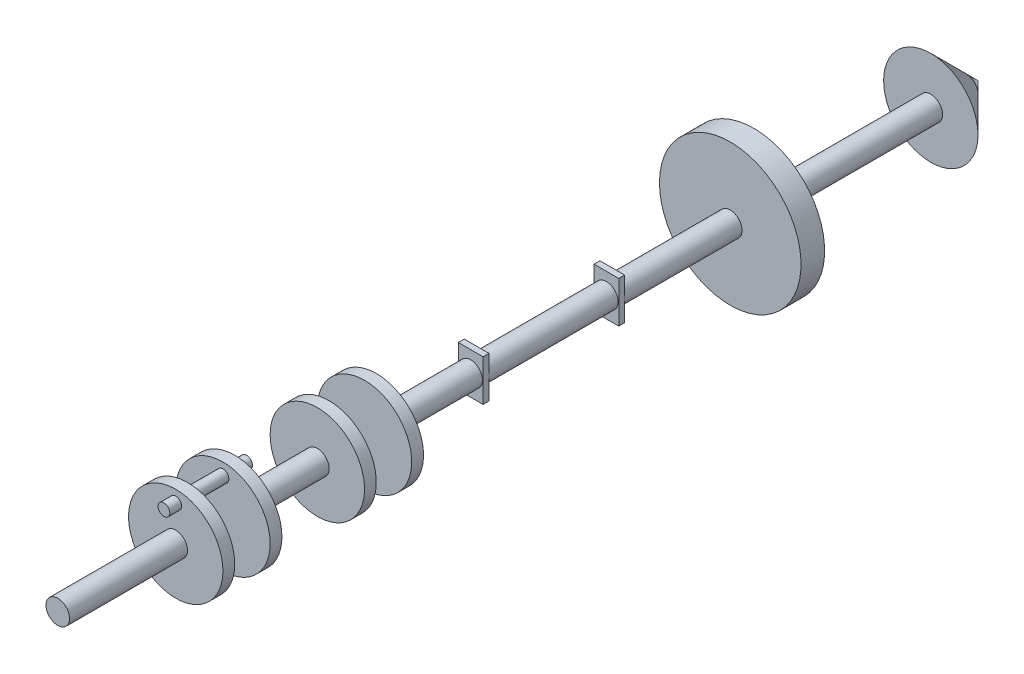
ISO-10303-21;
HEADER;
FILE_DESCRIPTION(('STEP AP214'),'2;1');
FILE_NAME('part.step','',(''),(''),'','','');
FILE_SCHEMA(('AUTOMOTIVE_DESIGN { 1 0 10303 214 1 1 1 1 }'));
ENDSEC;
DATA;
#1=APPLICATION_CONTEXT('core data for automotive mechanical design processes');
#2=APPLICATION_PROTOCOL_DEFINITION('international standard','automotive_design',2000,#1);
#3=PRODUCT_CONTEXT('',#1,'mechanical');
#4=PRODUCT('Part','Part','',(#3));
#5=PRODUCT_RELATED_PRODUCT_CATEGORY('part','',(#4));
#6=PRODUCT_DEFINITION_FORMATION('','',#4);
#7=PRODUCT_DEFINITION_CONTEXT('part definition',#1,'design');
#8=PRODUCT_DEFINITION('design','',#6,#7);
#9=PRODUCT_DEFINITION_SHAPE('','',#8);
#10=(LENGTH_UNIT() NAMED_UNIT(*) SI_UNIT(.MILLI.,.METRE.));
#11=(NAMED_UNIT(*) PLANE_ANGLE_UNIT() SI_UNIT($,.RADIAN.));
#12=(NAMED_UNIT(*) SI_UNIT($,.STERADIAN.) SOLID_ANGLE_UNIT());
#13=UNCERTAINTY_MEASURE_WITH_UNIT(LENGTH_MEASURE(1.E-05),#10,'distance_accuracy_value','');
#14=(GEOMETRIC_REPRESENTATION_CONTEXT(3) GLOBAL_UNCERTAINTY_ASSIGNED_CONTEXT((#13)) GLOBAL_UNIT_ASSIGNED_CONTEXT((#10,
#11,#12)) REPRESENTATION_CONTEXT('',''));
#15=CARTESIAN_POINT('',(0.,0.,0.));
#16=DIRECTION('',(0.,0.,1.));
#17=DIRECTION('',(1.,0.,0.));
#18=AXIS2_PLACEMENT_3D('',#15,#16,#17);
#19=CARTESIAN_POINT('',(0.,0.,90.));
#20=DIRECTION('',(0.,0.,1.));
#21=DIRECTION('',(1.,0.,0.));
#22=AXIS2_PLACEMENT_3D('',#19,#20,#21);
#23=PLANE('',#22);
#24=CARTESIAN_POINT('',(0.,0.,90.));
#25=DIRECTION('',(0.,0.,-1.));
#26=DIRECTION('',(-1.,0.,0.));
#27=AXIS2_PLACEMENT_3D('',#24,#25,#26);
#28=CIRCLE('',#27,40.);
#29=CARTESIAN_POINT('',(-40.,0.,90.));
#30=VERTEX_POINT('',#29);
#31=EDGE_CURVE('E12',#30,#30,#28,.T.);
#32=ORIENTED_EDGE('',*,*,#31,.F.);
#33=EDGE_LOOP('',(#32));
#34=FACE_BOUND('',#33,.T.);
#35=ADVANCED_FACE('F40',(#34),#23,.T.);
#36=CARTESIAN_POINT('',(0.,0.,-240.));
#37=DIRECTION('',(0.,0.,-1.));
#38=DIRECTION('',(-1.,0.,0.));
#39=AXIS2_PLACEMENT_3D('',#36,#37,#38);
#40=PLANE('',#39);
#41=CARTESIAN_POINT('',(0.,0.,-240.));
#42=DIRECTION('',(0.,0.,-1.));
#43=DIRECTION('',(-1.,0.,0.));
#44=AXIS2_PLACEMENT_3D('',#41,#42,#43);
#45=CIRCLE('',#44,60.);
#46=CARTESIAN_POINT('',(-60.,0.,-240.));
#47=VERTEX_POINT('',#46);
#48=EDGE_CURVE('E138',#47,#47,#45,.T.);
#49=ORIENTED_EDGE('',*,*,#48,.T.);
#50=EDGE_LOOP('',(#49));
#51=FACE_BOUND('',#50,.T.);
#52=CARTESIAN_POINT('',(0.,0.,-240.));
#53=DIRECTION('',(0.,0.,-1.));
#54=DIRECTION('',(-1.,0.,0.));
#55=AXIS2_PLACEMENT_3D('',#52,#53,#54);
#56=CIRCLE('',#55,10.);
#57=CARTESIAN_POINT('',(-10.,0.,-240.));
#58=VERTEX_POINT('',#57);
#59=EDGE_CURVE('E159',#58,#58,#56,.T.);
#60=ORIENTED_EDGE('',*,*,#59,.F.);
#61=EDGE_LOOP('',(#60));
#62=FACE_BOUND('',#61,.T.);
#63=ADVANCED_FACE('F185',(#51,#62),#40,.T.);
#64=CARTESIAN_POINT('',(10.5,17.5,-120.));
#65=DIRECTION('',(0.,0.,-1.));
#66=DIRECTION('',(-1.,0.,0.));
#67=AXIS2_PLACEMENT_3D('',#64,#65,#66);
#68=PLANE('',#67);
#69=DIRECTION('',(1.,0.,0.));
#70=VECTOR('',#69,1.);
#71=CARTESIAN_POINT('',(-10.5,17.5,-120.));
#72=LINE('',#71,#70);
#73=CARTESIAN_POINT('',(-10.5,17.5,-120.));
#74=VERTEX_POINT('',#73);
#75=CARTESIAN_POINT('',(10.5,17.5,-120.));
#76=VERTEX_POINT('',#75);
#77=EDGE_CURVE('E118',#74,#76,#72,.T.);
#78=ORIENTED_EDGE('',*,*,#77,.T.);
#79=DIRECTION('',(0.,-1.,0.));
#80=VECTOR('',#79,1.);
#81=CARTESIAN_POINT('',(10.5,17.5,-120.));
#82=LINE('',#81,#80);
#83=CARTESIAN_POINT('',(10.5,-17.5,-120.));
#84=VERTEX_POINT('',#83);
#85=EDGE_CURVE('E110',#76,#84,#82,.T.);
#86=ORIENTED_EDGE('',*,*,#85,.T.);
#87=DIRECTION('',(-1.,0.,0.));
#88=VECTOR('',#87,1.);
#89=CARTESIAN_POINT('',(10.5,-17.5,-120.));
#90=LINE('',#89,#88);
#91=CARTESIAN_POINT('',(-10.5,-17.5,-120.));
#92=VERTEX_POINT('',#91);
#93=EDGE_CURVE('E115',#84,#92,#90,.T.);
#94=ORIENTED_EDGE('',*,*,#93,.T.);
#95=DIRECTION('',(0.,1.,0.));
#96=VECTOR('',#95,1.);
#97=CARTESIAN_POINT('',(-10.5,-17.5,-120.));
#98=LINE('',#97,#96);
#99=EDGE_CURVE('E131',#92,#74,#98,.T.);
#100=ORIENTED_EDGE('',*,*,#99,.T.);
#101=EDGE_LOOP('',(#78,#86,#94,#100));
#102=FACE_BOUND('',#101,.T.);
#103=CARTESIAN_POINT('',(0.,0.,-120.));
#104=DIRECTION('',(0.,0.,-1.));
#105=DIRECTION('',(-1.,0.,0.));
#106=AXIS2_PLACEMENT_3D('',#103,#104,#105);
#107=CIRCLE('',#106,10.);
#108=CARTESIAN_POINT('',(-10.,0.,-120.));
#109=VERTEX_POINT('',#108);
#110=EDGE_CURVE('E152',#109,#109,#107,.T.);
#111=ORIENTED_EDGE('',*,*,#110,.F.);
#112=EDGE_LOOP('',(#111));
#113=FACE_BOUND('',#112,.T.);
#114=ADVANCED_FACE('F112',(#102,#113),#68,.T.);
#115=CARTESIAN_POINT('',(10.5,-17.5,-5.));
#116=DIRECTION('',(0.,0.,-1.));
#117=DIRECTION('',(-1.,0.,0.));
#118=AXIS2_PLACEMENT_3D('',#115,#116,#117);
#119=PLANE('',#118);
#120=DIRECTION('',(0.,-1.,0.));
#121=VECTOR('',#120,1.);
#122=CARTESIAN_POINT('',(10.5,17.5,-5.));
#123=LINE('',#122,#121);
#124=CARTESIAN_POINT('',(10.5,17.5,-5.));
#125=VERTEX_POINT('',#124);
#126=CARTESIAN_POINT('',(10.5,-17.5,-5.));
#127=VERTEX_POINT('',#126);
#128=EDGE_CURVE('E133',#125,#127,#123,.T.);
#129=ORIENTED_EDGE('',*,*,#128,.T.);
#130=DIRECTION('',(-1.,0.,0.));
#131=VECTOR('',#130,1.);
#132=CARTESIAN_POINT('',(10.5,-17.5,-5.));
#133=LINE('',#132,#131);
#134=CARTESIAN_POINT('',(-10.5,-17.5,-5.));
#135=VERTEX_POINT('',#134);
#136=EDGE_CURVE('E304',#127,#135,#133,.T.);
#137=ORIENTED_EDGE('',*,*,#136,.T.);
#138=DIRECTION('',(0.,1.,0.));
#139=VECTOR('',#138,1.);
#140=CARTESIAN_POINT('',(-10.5,17.5,-5.));
#141=LINE('',#140,#139);
#142=CARTESIAN_POINT('',(-10.5,17.5,-5.));
#143=VERTEX_POINT('',#142);
#144=EDGE_CURVE('E301',#135,#143,#141,.T.);
#145=ORIENTED_EDGE('',*,*,#144,.T.);
#146=DIRECTION('',(1.,0.,0.));
#147=VECTOR('',#146,1.);
#148=CARTESIAN_POINT('',(10.5,17.5,-5.));
#149=LINE('',#148,#147);
#150=EDGE_CURVE('E298',#143,#125,#149,.T.);
#151=ORIENTED_EDGE('',*,*,#150,.T.);
#152=EDGE_LOOP('',(#129,#137,#145,#151));
#153=FACE_BOUND('',#152,.T.);
#154=CARTESIAN_POINT('',(0.,0.,-5.));
#155=DIRECTION('',(0.,0.,-1.));
#156=DIRECTION('',(-1.,0.,0.));
#157=AXIS2_PLACEMENT_3D('',#154,#155,#156);
#158=CIRCLE('',#157,10.);
#159=CARTESIAN_POINT('',(-10.,0.,-5.));
#160=VERTEX_POINT('',#159);
#161=EDGE_CURVE('E280',#160,#160,#158,.T.);
#162=ORIENTED_EDGE('',*,*,#161,.F.);
#163=EDGE_LOOP('',(#162));
#164=FACE_BOUND('',#163,.T.);
#165=ADVANCED_FACE('F224',(#153,#164),#119,.T.);
#166=CARTESIAN_POINT('',(0.,0.,200.));
#167=DIRECTION('',(0.,0.,-1.));
#168=DIRECTION('',(-1.,0.,0.));
#169=AXIS2_PLACEMENT_3D('',#166,#167,#168);
#170=CYLINDRICAL_SURFACE('',#169,10.);
#171=CARTESIAN_POINT('',(0.,0.,80.));
#172=DIRECTION('',(0.,0.,-1.));
#173=DIRECTION('',(-1.,0.,0.));
#174=AXIS2_PLACEMENT_3D('',#171,#172,#173);
#175=CIRCLE('',#174,10.);
#176=CARTESIAN_POINT('',(-10.,0.,80.));
#177=VERTEX_POINT('',#176);
#178=EDGE_CURVE('E273',#177,#177,#175,.T.);
#179=ORIENTED_EDGE('',*,*,#178,.T.);
#180=EDGE_LOOP('',(#179));
#181=FACE_BOUND('',#180,.T.);
#182=CARTESIAN_POINT('',(0.,0.,0.));
#183=DIRECTION('',(0.,0.,-1.));
#184=DIRECTION('',(-1.,0.,0.));
#185=AXIS2_PLACEMENT_3D('',#182,#183,#184);
#186=CIRCLE('',#185,10.);
#187=CARTESIAN_POINT('',(-10.,0.,0.));
#188=VERTEX_POINT('',#187);
#189=EDGE_CURVE('E268',#188,#188,#186,.T.);
#190=ORIENTED_EDGE('',*,*,#189,.F.);
#191=EDGE_LOOP('',(#190));
#192=FACE_BOUND('',#191,.T.);
#193=ADVANCED_FACE('F42',(#181,#192),#170,.T.);
#194=CARTESIAN_POINT('',(10.5,-17.5,0.));
#195=DIRECTION('',(0.,0.,-1.));
#196=DIRECTION('',(-1.,0.,0.));
#197=AXIS2_PLACEMENT_3D('',#194,#195,#196);
#198=PLANE('',#197);
#199=DIRECTION('',(0.,-1.,0.));
#200=VECTOR('',#199,1.);
#201=CARTESIAN_POINT('',(10.5,17.5,0.));
#202=LINE('',#201,#200);
#203=CARTESIAN_POINT('',(10.5,17.5,0.));
#204=VERTEX_POINT('',#203);
#205=CARTESIAN_POINT('',(10.5,-17.5,0.));
#206=VERTEX_POINT('',#205);
#207=EDGE_CURVE('E263',#204,#206,#202,.T.);
#208=ORIENTED_EDGE('',*,*,#207,.F.);
#209=DIRECTION('',(1.,0.,0.));
#210=VECTOR('',#209,1.);
#211=CARTESIAN_POINT('',(10.5,17.5,0.));
#212=LINE('',#211,#210);
#213=CARTESIAN_POINT('',(-10.5,17.5,0.));
#214=VERTEX_POINT('',#213);
#215=EDGE_CURVE('E84',#214,#204,#212,.T.);
#216=ORIENTED_EDGE('',*,*,#215,.F.);
#217=DIRECTION('',(0.,1.,0.));
#218=VECTOR('',#217,1.);
#219=CARTESIAN_POINT('',(-10.5,17.5,0.));
#220=LINE('',#219,#218);
#221=CARTESIAN_POINT('',(-10.5,-17.5,0.));
#222=VERTEX_POINT('',#221);
#223=EDGE_CURVE('E308',#222,#214,#220,.T.);
#224=ORIENTED_EDGE('',*,*,#223,.F.);
#225=DIRECTION('',(-1.,0.,0.));
#226=VECTOR('',#225,1.);
#227=CARTESIAN_POINT('',(10.5,-17.5,0.));
#228=LINE('',#227,#226);
#229=EDGE_CURVE('E270',#206,#222,#228,.T.);
#230=ORIENTED_EDGE('',*,*,#229,.F.);
#231=EDGE_LOOP('',(#208,#216,#224,#230));
#232=FACE_BOUND('',#231,.T.);
#233=ORIENTED_EDGE('',*,*,#189,.T.);
#234=EDGE_LOOP('',(#233));
#235=FACE_BOUND('',#234,.T.);
#236=ADVANCED_FACE('F238',(#232,#235),#198,.F.);
#237=CARTESIAN_POINT('',(10.5,17.5,-5.));
#238=DIRECTION('',(-1.,0.,0.));
#239=DIRECTION('',(0.,-1.,0.));
#240=AXIS2_PLACEMENT_3D('',#237,#238,#239);
#241=PLANE('',#240);
#242=ORIENTED_EDGE('',*,*,#207,.T.);
#243=DIRECTION('',(0.,0.,1.));
#244=VECTOR('',#243,1.);
#245=CARTESIAN_POINT('',(10.5,-17.5,-5.));
#246=LINE('',#245,#244);
#247=EDGE_CURVE('E266',#127,#206,#246,.T.);
#248=ORIENTED_EDGE('',*,*,#247,.F.);
#249=ORIENTED_EDGE('',*,*,#128,.F.);
#250=DIRECTION('',(0.,0.,1.));
#251=VECTOR('',#250,1.);
#252=CARTESIAN_POINT('',(10.5,17.5,-5.));
#253=LINE('',#252,#251);
#254=EDGE_CURVE('E267',#125,#204,#253,.T.);
#255=ORIENTED_EDGE('',*,*,#254,.T.);
#256=EDGE_LOOP('',(#242,#248,#249,#255));
#257=FACE_BOUND('',#256,.T.);
#258=ADVANCED_FACE('F241',(#257),#241,.F.);
#259=CARTESIAN_POINT('',(10.5,-17.5,-5.));
#260=DIRECTION('',(0.,1.,0.));
#261=DIRECTION('',(-1.,0.,0.));
#262=AXIS2_PLACEMENT_3D('',#259,#260,#261);
#263=PLANE('',#262);
#264=ORIENTED_EDGE('',*,*,#229,.T.);
#265=DIRECTION('',(0.,0.,1.));
#266=VECTOR('',#265,1.);
#267=CARTESIAN_POINT('',(-10.5,-17.5,-5.));
#268=LINE('',#267,#266);
#269=EDGE_CURVE('E293',#135,#222,#268,.T.);
#270=ORIENTED_EDGE('',*,*,#269,.F.);
#271=ORIENTED_EDGE('',*,*,#136,.F.);
#272=ORIENTED_EDGE('',*,*,#247,.T.);
#273=EDGE_LOOP('',(#264,#270,#271,#272));
#274=FACE_BOUND('',#273,.T.);
#275=ADVANCED_FACE('F251',(#274),#263,.F.);
#276=CARTESIAN_POINT('',(-10.5,17.5,-5.));
#277=DIRECTION('',(1.,0.,0.));
#278=DIRECTION('',(0.,1.,0.));
#279=AXIS2_PLACEMENT_3D('',#276,#277,#278);
#280=PLANE('',#279);
#281=ORIENTED_EDGE('',*,*,#223,.T.);
#282=DIRECTION('',(0.,0.,1.));
#283=VECTOR('',#282,1.);
#284=CARTESIAN_POINT('',(-10.5,17.5,-5.));
#285=LINE('',#284,#283);
#286=EDGE_CURVE('E283',#143,#214,#285,.T.);
#287=ORIENTED_EDGE('',*,*,#286,.F.);
#288=ORIENTED_EDGE('',*,*,#144,.F.);
#289=ORIENTED_EDGE('',*,*,#269,.T.);
#290=EDGE_LOOP('',(#281,#287,#288,#289));
#291=FACE_BOUND('',#290,.T.);
#292=ADVANCED_FACE('F248',(#291),#280,.F.);
#293=CARTESIAN_POINT('',(10.5,17.5,-5.));
#294=DIRECTION('',(0.,-1.,0.));
#295=DIRECTION('',(1.,0.,0.));
#296=AXIS2_PLACEMENT_3D('',#293,#294,#295);
#297=PLANE('',#296);
#298=ORIENTED_EDGE('',*,*,#215,.T.);
#299=ORIENTED_EDGE('',*,*,#254,.F.);
#300=ORIENTED_EDGE('',*,*,#150,.F.);
#301=ORIENTED_EDGE('',*,*,#286,.T.);
#302=EDGE_LOOP('',(#298,#299,#300,#301));
#303=FACE_BOUND('',#302,.T.);
#304=ADVANCED_FACE('F236',(#303),#297,.F.);
#305=CARTESIAN_POINT('',(0.,0.,-115.));
#306=DIRECTION('',(0.,0.,1.));
#307=DIRECTION('',(1.,0.,0.));
#308=AXIS2_PLACEMENT_3D('',#305,#306,#307);
#309=CYLINDRICAL_SURFACE('',#308,10.);
#310=CARTESIAN_POINT('',(0.,0.,-115.));
#311=DIRECTION('',(0.,0.,-1.));
#312=DIRECTION('',(-1.,0.,0.));
#313=AXIS2_PLACEMENT_3D('',#310,#311,#312);
#314=CIRCLE('',#313,10.);
#315=CARTESIAN_POINT('',(-10.,0.,-115.));
#316=VERTEX_POINT('',#315);
#317=EDGE_CURVE('E147',#316,#316,#314,.T.);
#318=ORIENTED_EDGE('',*,*,#317,.F.);
#319=EDGE_LOOP('',(#318));
#320=FACE_BOUND('',#319,.T.);
#321=ORIENTED_EDGE('',*,*,#161,.T.);
#322=EDGE_LOOP('',(#321));
#323=FACE_BOUND('',#322,.T.);
#324=ADVANCED_FACE('F221',(#320,#323),#309,.T.);
#325=CARTESIAN_POINT('',(10.5,17.5,-115.));
#326=DIRECTION('',(0.,0.,-1.));
#327=DIRECTION('',(-1.,0.,0.));
#328=AXIS2_PLACEMENT_3D('',#325,#326,#327);
#329=PLANE('',#328);
#330=DIRECTION('',(1.,0.,0.));
#331=VECTOR('',#330,1.);
#332=CARTESIAN_POINT('',(-10.5,17.5,-115.));
#333=LINE('',#332,#331);
#334=CARTESIAN_POINT('',(-10.5,17.5,-115.));
#335=VERTEX_POINT('',#334);
#336=CARTESIAN_POINT('',(10.5,17.5,-115.));
#337=VERTEX_POINT('',#336);
#338=EDGE_CURVE('E144',#335,#337,#333,.T.);
#339=ORIENTED_EDGE('',*,*,#338,.F.);
#340=DIRECTION('',(0.,1.,0.));
#341=VECTOR('',#340,1.);
#342=CARTESIAN_POINT('',(-10.5,-17.5,-115.));
#343=LINE('',#342,#341);
#344=CARTESIAN_POINT('',(-10.5,-17.5,-115.));
#345=VERTEX_POINT('',#344);
#346=EDGE_CURVE('E59',#345,#335,#343,.T.);
#347=ORIENTED_EDGE('',*,*,#346,.F.);
#348=DIRECTION('',(-1.,0.,0.));
#349=VECTOR('',#348,1.);
#350=CARTESIAN_POINT('',(10.5,-17.5,-115.));
#351=LINE('',#350,#349);
#352=CARTESIAN_POINT('',(10.5,-17.5,-115.));
#353=VERTEX_POINT('',#352);
#354=EDGE_CURVE('E126',#353,#345,#351,.T.);
#355=ORIENTED_EDGE('',*,*,#354,.F.);
#356=DIRECTION('',(0.,-1.,0.));
#357=VECTOR('',#356,1.);
#358=CARTESIAN_POINT('',(10.5,17.5,-115.));
#359=LINE('',#358,#357);
#360=EDGE_CURVE('E75',#337,#353,#359,.T.);
#361=ORIENTED_EDGE('',*,*,#360,.F.);
#362=EDGE_LOOP('',(#339,#347,#355,#361));
#363=FACE_BOUND('',#362,.T.);
#364=ORIENTED_EDGE('',*,*,#317,.T.);
#365=EDGE_LOOP('',(#364));
#366=FACE_BOUND('',#365,.T.);
#367=ADVANCED_FACE('F217',(#363,#366),#329,.F.);
#368=CARTESIAN_POINT('',(-10.5,17.5,-120.));
#369=DIRECTION('',(0.,-1.,0.));
#370=DIRECTION('',(1.,0.,0.));
#371=AXIS2_PLACEMENT_3D('',#368,#369,#370);
#372=PLANE('',#371);
#373=ORIENTED_EDGE('',*,*,#338,.T.);
#374=DIRECTION('',(0.,0.,1.));
#375=VECTOR('',#374,1.);
#376=CARTESIAN_POINT('',(10.5,17.5,-120.));
#377=LINE('',#376,#375);
#378=EDGE_CURVE('E141',#76,#337,#377,.T.);
#379=ORIENTED_EDGE('',*,*,#378,.F.);
#380=ORIENTED_EDGE('',*,*,#77,.F.);
#381=DIRECTION('',(0.,0.,1.));
#382=VECTOR('',#381,1.);
#383=CARTESIAN_POINT('',(-10.5,17.5,-120.));
#384=LINE('',#383,#382);
#385=EDGE_CURVE('E143',#74,#335,#384,.T.);
#386=ORIENTED_EDGE('',*,*,#385,.T.);
#387=EDGE_LOOP('',(#373,#379,#380,#386));
#388=FACE_BOUND('',#387,.T.);
#389=ADVANCED_FACE('F220',(#388),#372,.F.);
#390=CARTESIAN_POINT('',(10.5,17.5,-120.));
#391=DIRECTION('',(-1.,0.,0.));
#392=DIRECTION('',(0.,-1.,0.));
#393=AXIS2_PLACEMENT_3D('',#390,#391,#392);
#394=PLANE('',#393);
#395=ORIENTED_EDGE('',*,*,#360,.T.);
#396=DIRECTION('',(0.,0.,1.));
#397=VECTOR('',#396,1.);
#398=CARTESIAN_POINT('',(10.5,-17.5,-120.));
#399=LINE('',#398,#397);
#400=EDGE_CURVE('E123',#84,#353,#399,.T.);
#401=ORIENTED_EDGE('',*,*,#400,.F.);
#402=ORIENTED_EDGE('',*,*,#85,.F.);
#403=ORIENTED_EDGE('',*,*,#378,.T.);
#404=EDGE_LOOP('',(#395,#401,#402,#403));
#405=FACE_BOUND('',#404,.T.);
#406=ADVANCED_FACE('F124',(#405),#394,.F.);
#407=CARTESIAN_POINT('',(10.5,-17.5,-120.));
#408=DIRECTION('',(0.,1.,0.));
#409=DIRECTION('',(-1.,0.,0.));
#410=AXIS2_PLACEMENT_3D('',#407,#408,#409);
#411=PLANE('',#410);
#412=ORIENTED_EDGE('',*,*,#354,.T.);
#413=DIRECTION('',(0.,0.,1.));
#414=VECTOR('',#413,1.);
#415=CARTESIAN_POINT('',(-10.5,-17.5,-120.));
#416=LINE('',#415,#414);
#417=EDGE_CURVE('E129',#92,#345,#416,.T.);
#418=ORIENTED_EDGE('',*,*,#417,.F.);
#419=ORIENTED_EDGE('',*,*,#93,.F.);
#420=ORIENTED_EDGE('',*,*,#400,.T.);
#421=EDGE_LOOP('',(#412,#418,#419,#420));
#422=FACE_BOUND('',#421,.T.);
#423=ADVANCED_FACE('F128',(#422),#411,.F.);
#424=CARTESIAN_POINT('',(-10.5,-17.5,-120.));
#425=DIRECTION('',(1.,0.,0.));
#426=DIRECTION('',(0.,1.,0.));
#427=AXIS2_PLACEMENT_3D('',#424,#425,#426);
#428=PLANE('',#427);
#429=ORIENTED_EDGE('',*,*,#346,.T.);
#430=ORIENTED_EDGE('',*,*,#385,.F.);
#431=ORIENTED_EDGE('',*,*,#99,.F.);
#432=ORIENTED_EDGE('',*,*,#417,.T.);
#433=EDGE_LOOP('',(#429,#430,#431,#432));
#434=FACE_BOUND('',#433,.T.);
#435=ADVANCED_FACE('F215',(#434),#428,.F.);
#436=CARTESIAN_POINT('',(0.,0.,-220.));
#437=DIRECTION('',(0.,0.,1.));
#438=DIRECTION('',(1.,0.,0.));
#439=AXIS2_PLACEMENT_3D('',#436,#437,#438);
#440=CYLINDRICAL_SURFACE('',#439,10.);
#441=CARTESIAN_POINT('',(0.,0.,-220.));
#442=DIRECTION('',(0.,0.,-1.));
#443=DIRECTION('',(-1.,0.,0.));
#444=AXIS2_PLACEMENT_3D('',#441,#442,#443);
#445=CIRCLE('',#444,10.);
#446=CARTESIAN_POINT('',(-10.,0.,-220.));
#447=VERTEX_POINT('',#446);
#448=EDGE_CURVE('E148',#447,#447,#445,.T.);
#449=ORIENTED_EDGE('',*,*,#448,.F.);
#450=EDGE_LOOP('',(#449));
#451=FACE_BOUND('',#450,.T.);
#452=ORIENTED_EDGE('',*,*,#110,.T.);
#453=EDGE_LOOP('',(#452));
#454=FACE_BOUND('',#453,.T.);
#455=ADVANCED_FACE('F207',(#451,#454),#440,.T.);
#456=CARTESIAN_POINT('',(0.,0.,-220.));
#457=DIRECTION('',(0.,0.,-1.));
#458=DIRECTION('',(-1.,0.,0.));
#459=AXIS2_PLACEMENT_3D('',#456,#457,#458);
#460=PLANE('',#459);
#461=CARTESIAN_POINT('',(0.,0.,-220.));
#462=DIRECTION('',(0.,0.,-1.));
#463=DIRECTION('',(-1.,0.,0.));
#464=AXIS2_PLACEMENT_3D('',#461,#462,#463);
#465=CIRCLE('',#464,60.);
#466=CARTESIAN_POINT('',(-60.,0.,-220.));
#467=VERTEX_POINT('',#466);
#468=EDGE_CURVE('E151',#467,#467,#465,.T.);
#469=ORIENTED_EDGE('',*,*,#468,.F.);
#470=EDGE_LOOP('',(#469));
#471=FACE_BOUND('',#470,.T.);
#472=ORIENTED_EDGE('',*,*,#448,.T.);
#473=EDGE_LOOP('',(#472));
#474=FACE_BOUND('',#473,.T.);
#475=ADVANCED_FACE('F205',(#471,#474),#460,.F.);
#476=CARTESIAN_POINT('',(0.,0.,-240.));
#477=DIRECTION('',(0.,0.,1.));
#478=DIRECTION('',(1.,0.,0.));
#479=AXIS2_PLACEMENT_3D('',#476,#477,#478);
#480=CYLINDRICAL_SURFACE('',#479,60.);
#481=ORIENTED_EDGE('',*,*,#48,.F.);
#482=EDGE_LOOP('',(#481));
#483=FACE_BOUND('',#482,.T.);
#484=ORIENTED_EDGE('',*,*,#468,.T.);
#485=EDGE_LOOP('',(#484));
#486=FACE_BOUND('',#485,.T.);
#487=ADVANCED_FACE('F203',(#483,#486),#480,.T.);
#488=CARTESIAN_POINT('',(0.,0.,-390.));
#489=DIRECTION('',(0.,0.,1.));
#490=DIRECTION('',(1.,0.,0.));
#491=AXIS2_PLACEMENT_3D('',#488,#489,#490);
#492=CYLINDRICAL_SURFACE('',#491,10.);
#493=CARTESIAN_POINT('',(0.,0.,-390.));
#494=DIRECTION('',(0.,0.,-1.));
#495=DIRECTION('',(-1.,0.,0.));
#496=AXIS2_PLACEMENT_3D('',#493,#494,#495);
#497=CIRCLE('',#496,10.);
#498=CARTESIAN_POINT('',(-10.,0.,-390.));
#499=VERTEX_POINT('',#498);
#500=EDGE_CURVE('E160',#499,#499,#497,.T.);
#501=ORIENTED_EDGE('',*,*,#500,.F.);
#502=EDGE_LOOP('',(#501));
#503=FACE_BOUND('',#502,.T.);
#504=ORIENTED_EDGE('',*,*,#59,.T.);
#505=EDGE_LOOP('',(#504));
#506=FACE_BOUND('',#505,.T.);
#507=ADVANCED_FACE('F199',(#503,#506),#492,.T.);
#508=CARTESIAN_POINT('',(0.,0.,-390.));
#509=DIRECTION('',(0.,0.,1.));
#510=DIRECTION('',(0.,-1.,0.));
#511=AXIS2_PLACEMENT_3D('',#508,#509,#510);
#512=PLANE('',#511);
#513=CARTESIAN_POINT('',(0.,0.,-390.));
#514=DIRECTION('',(0.,0.,-1.));
#515=DIRECTION('',(0.,1.,0.));
#516=AXIS2_PLACEMENT_3D('',#513,#514,#515);
#517=CIRCLE('',#516,40.);
#518=CARTESIAN_POINT('',(0.,40.,-390.));
#519=VERTEX_POINT('',#518);
#520=EDGE_CURVE('E163',#519,#519,#517,.T.);
#521=ORIENTED_EDGE('',*,*,#520,.F.);
#522=EDGE_LOOP('',(#521));
#523=FACE_BOUND('',#522,.T.);
#524=ORIENTED_EDGE('',*,*,#500,.T.);
#525=EDGE_LOOP('',(#524));
#526=FACE_BOUND('',#525,.T.);
#527=ADVANCED_FACE('F196',(#523,#526),#512,.T.);
#528=CARTESIAN_POINT('',(0.,0.,-430.));
#529=DIRECTION('',(0.,0.,1.));
#530=DIRECTION('',(0.,-1.,0.));
#531=AXIS2_PLACEMENT_3D('',#528,#529,#530);
#532=CONICAL_SURFACE('',#531,0.,0.785398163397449);
#533=ORIENTED_EDGE('',*,*,#520,.T.);
#534=EDGE_LOOP('',(#533));
#535=FACE_BOUND('',#534,.T.);
#536=CARTESIAN_POINT('',(0.,0.,-430.));
#537=VERTEX_POINT('',#536);
#538=VERTEX_LOOP('',#537);
#539=FACE_BOUND('',#538,.T.);
#540=ADVANCED_FACE('F182',(#535,#539),#532,.T.);
#541=CARTESIAN_POINT('',(0.,0.,80.));
#542=DIRECTION('',(0.,0.,-1.));
#543=DIRECTION('',(-1.,0.,0.));
#544=AXIS2_PLACEMENT_3D('',#541,#542,#543);
#545=PLANE('',#544);
#546=CARTESIAN_POINT('',(0.,0.,80.));
#547=DIRECTION('',(0.,0.,-1.));
#548=DIRECTION('',(-1.,0.,0.));
#549=AXIS2_PLACEMENT_3D('',#546,#547,#548);
#550=CIRCLE('',#549,40.);
#551=CARTESIAN_POINT('',(-40.,0.,80.));
#552=VERTEX_POINT('',#551);
#553=EDGE_CURVE('E44',#552,#552,#550,.T.);
#554=ORIENTED_EDGE('',*,*,#553,.T.);
#555=EDGE_LOOP('',(#554));
#556=FACE_BOUND('',#555,.T.);
#557=ORIENTED_EDGE('',*,*,#178,.F.);
#558=EDGE_LOOP('',(#557));
#559=FACE_BOUND('',#558,.T.);
#560=ADVANCED_FACE('F172',(#556,#559),#545,.T.);
#561=CARTESIAN_POINT('',(0.,0.,0.));
#562=DIRECTION('',(0.,0.,-1.));
#563=DIRECTION('',(-1.,0.,0.));
#564=AXIS2_PLACEMENT_3D('',#561,#562,#563);
#565=CYLINDRICAL_SURFACE('',#564,40.);
#566=ORIENTED_EDGE('',*,*,#31,.T.);
#567=EDGE_LOOP('',(#566));
#568=FACE_BOUND('',#567,.T.);
#569=ORIENTED_EDGE('',*,*,#553,.F.);
#570=EDGE_LOOP('',(#569));
#571=FACE_BOUND('',#570,.T.);
#572=ADVANCED_FACE('F175',(#568,#571),#565,.T.);
#573=CLOSED_SHELL('',(#35,#63,#114,#165,#193,#236,#258,#275,#292,#304,#324,#367,#389,#406,#423,
#435,#455,#475,#487,#507,#527,#540,#560,#572));
#574=MANIFOLD_SOLID_BREP('B2',#573);
#575=CARTESIAN_POINT('',(0.,0.,350.));
#576=DIRECTION('',(0.,0.,1.));
#577=DIRECTION('',(1.,0.,0.));
#578=AXIS2_PLACEMENT_3D('',#575,#576,#577);
#579=PLANE('',#578);
#580=CARTESIAN_POINT('',(0.,0.,350.));
#581=DIRECTION('',(0.,0.,1.));
#582=DIRECTION('',(1.,0.,0.));
#583=AXIS2_PLACEMENT_3D('',#580,#581,#582);
#584=CIRCLE('',#583,10.);
#585=CARTESIAN_POINT('',(10.,0.,350.));
#586=VERTEX_POINT('',#585);
#587=EDGE_CURVE('E521',#586,#586,#584,.T.);
#588=ORIENTED_EDGE('',*,*,#587,.T.);
#589=EDGE_LOOP('',(#588));
#590=FACE_BOUND('',#589,.T.);
#591=ADVANCED_FACE('F480',(#590),#579,.T.);
#592=CARTESIAN_POINT('',(0.,30.,260.));
#593=DIRECTION('',(0.,0.,1.));
#594=DIRECTION('',(1.,0.,0.));
#595=AXIS2_PLACEMENT_3D('',#592,#593,#594);
#596=PLANE('',#595);
#597=CARTESIAN_POINT('',(0.,30.,260.));
#598=DIRECTION('',(0.,0.,1.));
#599=DIRECTION('',(1.,0.,0.));
#600=AXIS2_PLACEMENT_3D('',#597,#598,#599);
#601=CIRCLE('',#600,5.);
#602=CARTESIAN_POINT('',(5.,30.,260.));
#603=VERTEX_POINT('',#602);
#604=EDGE_CURVE('E515',#603,#603,#601,.T.);
#605=ORIENTED_EDGE('',*,*,#604,.T.);
#606=EDGE_LOOP('',(#605));
#607=FACE_BOUND('',#606,.T.);
#608=ADVANCED_FACE('F547',(#607),#596,.T.);
#609=CARTESIAN_POINT('',(0.,0.,350.));
#610=DIRECTION('',(0.,0.,-1.));
#611=DIRECTION('',(-1.,0.,0.));
#612=AXIS2_PLACEMENT_3D('',#609,#610,#611);
#613=CYLINDRICAL_SURFACE('',#612,10.);
#614=ORIENTED_EDGE('',*,*,#587,.F.);
#615=EDGE_LOOP('',(#614));
#616=FACE_BOUND('',#615,.T.);
#617=CARTESIAN_POINT('',(0.,0.,250.));
#618=DIRECTION('',(0.,0.,1.));
#619=DIRECTION('',(1.,0.,0.));
#620=AXIS2_PLACEMENT_3D('',#617,#618,#619);
#621=CIRCLE('',#620,10.);
#622=CARTESIAN_POINT('',(10.,0.,250.));
#623=VERTEX_POINT('',#622);
#624=EDGE_CURVE('E524',#623,#623,#621,.T.);
#625=ORIENTED_EDGE('',*,*,#624,.T.);
#626=EDGE_LOOP('',(#625));
#627=FACE_BOUND('',#626,.T.);
#628=ADVANCED_FACE('F553',(#616,#627),#613,.T.);
#629=CARTESIAN_POINT('',(0.,30.,260.));
#630=DIRECTION('',(0.,0.,-1.));
#631=DIRECTION('',(-1.,0.,0.));
#632=AXIS2_PLACEMENT_3D('',#629,#630,#631);
#633=CYLINDRICAL_SURFACE('',#632,5.);
#634=ORIENTED_EDGE('',*,*,#604,.F.);
#635=EDGE_LOOP('',(#634));
#636=FACE_BOUND('',#635,.T.);
#637=CARTESIAN_POINT('',(0.,30.,250.));
#638=DIRECTION('',(0.,0.,1.));
#639=DIRECTION('',(1.,0.,0.));
#640=AXIS2_PLACEMENT_3D('',#637,#638,#639);
#641=CIRCLE('',#640,5.);
#642=CARTESIAN_POINT('',(5.,30.,250.));
#643=VERTEX_POINT('',#642);
#644=EDGE_CURVE('E518',#643,#643,#641,.T.);
#645=ORIENTED_EDGE('',*,*,#644,.T.);
#646=EDGE_LOOP('',(#645));
#647=FACE_BOUND('',#646,.T.);
#648=ADVANCED_FACE('F558',(#636,#647),#633,.T.);
#649=CARTESIAN_POINT('',(0.,0.,250.));
#650=DIRECTION('',(0.,0.,1.));
#651=DIRECTION('',(1.,0.,0.));
#652=AXIS2_PLACEMENT_3D('',#649,#650,#651);
#653=PLANE('',#652);
#654=ORIENTED_EDGE('',*,*,#644,.F.);
#655=EDGE_LOOP('',(#654));
#656=FACE_BOUND('',#655,.T.);
#657=CARTESIAN_POINT('',(0.,0.,250.));
#658=DIRECTION('',(0.,0.,1.));
#659=DIRECTION('',(1.,0.,0.));
#660=AXIS2_PLACEMENT_3D('',#657,#658,#659);
#661=CIRCLE('',#660,40.);
#662=CARTESIAN_POINT('',(40.,0.,250.));
#663=VERTEX_POINT('',#662);
#664=EDGE_CURVE('E509',#663,#663,#661,.T.);
#665=ORIENTED_EDGE('',*,*,#664,.T.);
#666=EDGE_LOOP('',(#665));
#667=FACE_BOUND('',#666,.T.);
#668=ORIENTED_EDGE('',*,*,#624,.F.);
#669=EDGE_LOOP('',(#668));
#670=FACE_BOUND('',#669,.T.);
#671=ADVANCED_FACE('F563',(#656,#667,#670),#653,.T.);
#672=CARTESIAN_POINT('',(0.,0.,250.));
#673=DIRECTION('',(0.,0.,-1.));
#674=DIRECTION('',(-1.,0.,0.));
#675=AXIS2_PLACEMENT_3D('',#672,#673,#674);
#676=CYLINDRICAL_SURFACE('',#675,40.);
#677=ORIENTED_EDGE('',*,*,#664,.F.);
#678=EDGE_LOOP('',(#677));
#679=FACE_BOUND('',#678,.T.);
#680=CARTESIAN_POINT('',(0.,0.,240.));
#681=DIRECTION('',(0.,0.,1.));
#682=DIRECTION('',(1.,0.,0.));
#683=AXIS2_PLACEMENT_3D('',#680,#681,#682);
#684=CIRCLE('',#683,40.);
#685=CARTESIAN_POINT('',(40.,0.,240.));
#686=VERTEX_POINT('',#685);
#687=EDGE_CURVE('E512',#686,#686,#684,.T.);
#688=ORIENTED_EDGE('',*,*,#687,.T.);
#689=EDGE_LOOP('',(#688));
#690=FACE_BOUND('',#689,.T.);
#691=ADVANCED_FACE('F569',(#679,#690),#676,.T.);
#692=CARTESIAN_POINT('',(0.,0.,240.));
#693=DIRECTION('',(0.,0.,1.));
#694=DIRECTION('',(1.,0.,0.));
#695=AXIS2_PLACEMENT_3D('',#692,#693,#694);
#696=PLANE('',#695);
#697=ORIENTED_EDGE('',*,*,#687,.F.);
#698=EDGE_LOOP('',(#697));
#699=FACE_BOUND('',#698,.T.);
#700=CARTESIAN_POINT('',(0.,30.,240.));
#701=DIRECTION('',(0.,0.,1.));
#702=DIRECTION('',(1.,0.,0.));
#703=AXIS2_PLACEMENT_3D('',#700,#701,#702);
#704=CIRCLE('',#703,5.);
#705=CARTESIAN_POINT('',(5.,30.,240.));
#706=VERTEX_POINT('',#705);
#707=EDGE_CURVE('E503',#706,#706,#704,.T.);
#708=ORIENTED_EDGE('',*,*,#707,.T.);
#709=EDGE_LOOP('',(#708));
#710=FACE_BOUND('',#709,.T.);
#711=ADVANCED_FACE('F565',(#699,#710),#696,.F.);
#712=CARTESIAN_POINT('',(0.,30.,240.));
#713=DIRECTION('',(0.,0.,-1.));
#714=DIRECTION('',(-1.,0.,0.));
#715=AXIS2_PLACEMENT_3D('',#712,#713,#714);
#716=CYLINDRICAL_SURFACE('',#715,5.);
#717=ORIENTED_EDGE('',*,*,#707,.F.);
#718=EDGE_LOOP('',(#717));
#719=FACE_BOUND('',#718,.T.);
#720=CARTESIAN_POINT('',(0.,30.,210.));
#721=DIRECTION('',(0.,0.,1.));
#722=DIRECTION('',(1.,0.,0.));
#723=AXIS2_PLACEMENT_3D('',#720,#721,#722);
#724=CIRCLE('',#723,5.);
#725=CARTESIAN_POINT('',(5.,30.,210.));
#726=VERTEX_POINT('',#725);
#727=EDGE_CURVE('E506',#726,#726,#724,.T.);
#728=ORIENTED_EDGE('',*,*,#727,.T.);
#729=EDGE_LOOP('',(#728));
#730=FACE_BOUND('',#729,.T.);
#731=ADVANCED_FACE('F568',(#719,#730),#716,.T.);
#732=CARTESIAN_POINT('',(0.,30.,190.));
#733=DIRECTION('',(0.,0.,-1.));
#734=DIRECTION('',(-1.,0.,0.));
#735=AXIS2_PLACEMENT_3D('',#732,#733,#734);
#736=PLANE('',#735);
#737=CARTESIAN_POINT('',(0.,30.,190.));
#738=DIRECTION('',(0.,0.,-1.));
#739=DIRECTION('',(-1.,0.,0.));
#740=AXIS2_PLACEMENT_3D('',#737,#738,#739);
#741=CIRCLE('',#740,5.);
#742=CARTESIAN_POINT('',(-5.,30.,190.));
#743=VERTEX_POINT('',#742);
#744=EDGE_CURVE('E500',#743,#743,#741,.T.);
#745=ORIENTED_EDGE('',*,*,#744,.T.);
#746=EDGE_LOOP('',(#745));
#747=FACE_BOUND('',#746,.T.);
#748=ADVANCED_FACE('F579',(#747),#736,.T.);
#749=CARTESIAN_POINT('',(0.,0.,210.));
#750=DIRECTION('',(0.,0.,1.));
#751=DIRECTION('',(1.,0.,0.));
#752=AXIS2_PLACEMENT_3D('',#749,#750,#751);
#753=PLANE('',#752);
#754=CARTESIAN_POINT('',(0.,0.,210.));
#755=DIRECTION('',(0.,0.,1.));
#756=DIRECTION('',(1.,0.,0.));
#757=AXIS2_PLACEMENT_3D('',#754,#755,#756);
#758=CIRCLE('',#757,40.);
#759=CARTESIAN_POINT('',(40.,0.,210.));
#760=VERTEX_POINT('',#759);
#761=EDGE_CURVE('E492',#760,#760,#758,.T.);
#762=ORIENTED_EDGE('',*,*,#761,.T.);
#763=EDGE_LOOP('',(#762));
#764=FACE_BOUND('',#763,.T.);
#765=ORIENTED_EDGE('',*,*,#727,.F.);
#766=EDGE_LOOP('',(#765));
#767=FACE_BOUND('',#766,.T.);
#768=ADVANCED_FACE('F583',(#764,#767),#753,.T.);
#769=CARTESIAN_POINT('',(0.,30.,190.));
#770=DIRECTION('',(0.,0.,1.));
#771=DIRECTION('',(1.,0.,0.));
#772=AXIS2_PLACEMENT_3D('',#769,#770,#771);
#773=CYLINDRICAL_SURFACE('',#772,5.);
#774=ORIENTED_EDGE('',*,*,#744,.F.);
#775=EDGE_LOOP('',(#774));
#776=FACE_BOUND('',#775,.T.);
#777=CARTESIAN_POINT('',(0.,30.,200.));
#778=DIRECTION('',(0.,0.,1.));
#779=DIRECTION('',(1.,0.,0.));
#780=AXIS2_PLACEMENT_3D('',#777,#778,#779);
#781=CIRCLE('',#780,5.);
#782=CARTESIAN_POINT('',(5.,30.,200.));
#783=VERTEX_POINT('',#782);
#784=EDGE_CURVE('E39',#783,#783,#781,.F.);
#785=ORIENTED_EDGE('',*,*,#784,.T.);
#786=EDGE_LOOP('',(#785));
#787=FACE_BOUND('',#786,.T.);
#788=ADVANCED_FACE('F585',(#776,#787),#773,.T.);
#789=CARTESIAN_POINT('',(0.,0.,210.));
#790=DIRECTION('',(0.,0.,-1.));
#791=DIRECTION('',(-1.,0.,0.));
#792=AXIS2_PLACEMENT_3D('',#789,#790,#791);
#793=CYLINDRICAL_SURFACE('',#792,40.);
#794=ORIENTED_EDGE('',*,*,#761,.F.);
#795=EDGE_LOOP('',(#794));
#796=FACE_BOUND('',#795,.T.);
#797=CARTESIAN_POINT('',(0.,0.,200.));
#798=DIRECTION('',(0.,0.,1.));
#799=DIRECTION('',(1.,0.,0.));
#800=AXIS2_PLACEMENT_3D('',#797,#798,#799);
#801=CIRCLE('',#800,40.);
#802=CARTESIAN_POINT('',(40.,0.,200.));
#803=VERTEX_POINT('',#802);
#804=EDGE_CURVE('E497',#803,#803,#801,.T.);
#805=ORIENTED_EDGE('',*,*,#804,.T.);
#806=EDGE_LOOP('',(#805));
#807=FACE_BOUND('',#806,.T.);
#808=ADVANCED_FACE('F588',(#796,#807),#793,.T.);
#809=CARTESIAN_POINT('',(0.,0.,200.));
#810=DIRECTION('',(0.,0.,1.));
#811=DIRECTION('',(1.,0.,0.));
#812=AXIS2_PLACEMENT_3D('',#809,#810,#811);
#813=PLANE('',#812);
#814=CARTESIAN_POINT('',(0.,0.,200.));
#815=DIRECTION('',(0.,0.,1.));
#816=DIRECTION('',(1.,0.,0.));
#817=AXIS2_PLACEMENT_3D('',#814,#815,#816);
#818=CIRCLE('',#817,10.);
#819=CARTESIAN_POINT('',(10.,0.,200.));
#820=VERTEX_POINT('',#819);
#821=EDGE_CURVE('E488',#820,#820,#818,.T.);
#822=ORIENTED_EDGE('',*,*,#821,.T.);
#823=EDGE_LOOP('',(#822));
#824=FACE_BOUND('',#823,.T.);
#825=ORIENTED_EDGE('',*,*,#804,.F.);
#826=EDGE_LOOP('',(#825));
#827=FACE_BOUND('',#826,.T.);
#828=ORIENTED_EDGE('',*,*,#784,.F.);
#829=EDGE_LOOP('',(#828));
#830=FACE_BOUND('',#829,.T.);
#831=ADVANCED_FACE('F590',(#824,#827,#830),#813,.F.);
#832=CARTESIAN_POINT('',(0.,0.,200.));
#833=DIRECTION('',(0.,0.,-1.));
#834=DIRECTION('',(-1.,0.,0.));
#835=AXIS2_PLACEMENT_3D('',#832,#833,#834);
#836=CYLINDRICAL_SURFACE('',#835,10.);
#837=CARTESIAN_POINT('',(0.,0.,130.));
#838=DIRECTION('',(0.,0.,1.));
#839=DIRECTION('',(1.,0.,0.));
#840=AXIS2_PLACEMENT_3D('',#837,#838,#839);
#841=CIRCLE('',#840,10.);
#842=CARTESIAN_POINT('',(10.,0.,130.));
#843=VERTEX_POINT('',#842);
#844=EDGE_CURVE('E484',#843,#843,#841,.T.);
#845=ORIENTED_EDGE('',*,*,#844,.T.);
#846=EDGE_LOOP('',(#845));
#847=FACE_BOUND('',#846,.T.);
#848=ORIENTED_EDGE('',*,*,#821,.F.);
#849=EDGE_LOOP('',(#848));
#850=FACE_BOUND('',#849,.T.);
#851=ADVANCED_FACE('F482',(#847,#850),#836,.T.);
#852=CARTESIAN_POINT('',(0.,0.,130.));
#853=DIRECTION('',(0.,0.,1.));
#854=DIRECTION('',(1.,0.,0.));
#855=AXIS2_PLACEMENT_3D('',#852,#853,#854);
#856=PLANE('',#855);
#857=CARTESIAN_POINT('',(0.,0.,130.));
#858=DIRECTION('',(0.,0.,-1.));
#859=DIRECTION('',(-1.,0.,0.));
#860=AXIS2_PLACEMENT_3D('',#857,#858,#859);
#861=CIRCLE('',#860,40.);
#862=CARTESIAN_POINT('',(-40.,0.,130.));
#863=VERTEX_POINT('',#862);
#864=EDGE_CURVE('E527',#863,#863,#861,.T.);
#865=ORIENTED_EDGE('',*,*,#864,.F.);
#866=EDGE_LOOP('',(#865));
#867=FACE_BOUND('',#866,.T.);
#868=ORIENTED_EDGE('',*,*,#844,.F.);
#869=EDGE_LOOP('',(#868));
#870=FACE_BOUND('',#869,.T.);
#871=ADVANCED_FACE('F543',(#867,#870),#856,.T.);
#872=CARTESIAN_POINT('',(0.,0.,120.));
#873=DIRECTION('',(0.,0.,-1.));
#874=DIRECTION('',(-1.,0.,0.));
#875=AXIS2_PLACEMENT_3D('',#872,#873,#874);
#876=PLANE('',#875);
#877=CARTESIAN_POINT('',(0.,0.,120.));
#878=DIRECTION('',(0.,0.,-1.));
#879=DIRECTION('',(-1.,0.,0.));
#880=AXIS2_PLACEMENT_3D('',#877,#878,#879);
#881=CIRCLE('',#880,40.);
#882=CARTESIAN_POINT('',(-40.,0.,120.));
#883=VERTEX_POINT('',#882);
#884=EDGE_CURVE('E530',#883,#883,#881,.T.);
#885=ORIENTED_EDGE('',*,*,#884,.T.);
#886=EDGE_LOOP('',(#885));
#887=FACE_BOUND('',#886,.T.);
#888=ADVANCED_FACE('F534',(#887),#876,.T.);
#889=CARTESIAN_POINT('',(0.,0.,0.));
#890=DIRECTION('',(0.,0.,-1.));
#891=DIRECTION('',(-1.,0.,0.));
#892=AXIS2_PLACEMENT_3D('',#889,#890,#891);
#893=CYLINDRICAL_SURFACE('',#892,40.);
#894=ORIENTED_EDGE('',*,*,#864,.T.);
#895=EDGE_LOOP('',(#894));
#896=FACE_BOUND('',#895,.T.);
#897=ORIENTED_EDGE('',*,*,#884,.F.);
#898=EDGE_LOOP('',(#897));
#899=FACE_BOUND('',#898,.T.);
#900=ADVANCED_FACE('F536',(#896,#899),#893,.T.);
#901=CLOSED_SHELL('',(#591,#608,#628,#648,#671,#691,#711,#731,#748,#768,#788,#808,#831,#851,
#871,#888,#900));
#902=MANIFOLD_SOLID_BREP('B6',#901);
#903=ADVANCED_BREP_SHAPE_REPRESENTATION('',(#18,#574,#902),#14);
#904=SHAPE_DEFINITION_REPRESENTATION(#9,#903);
ENDSEC;
END-ISO-10303-21;
